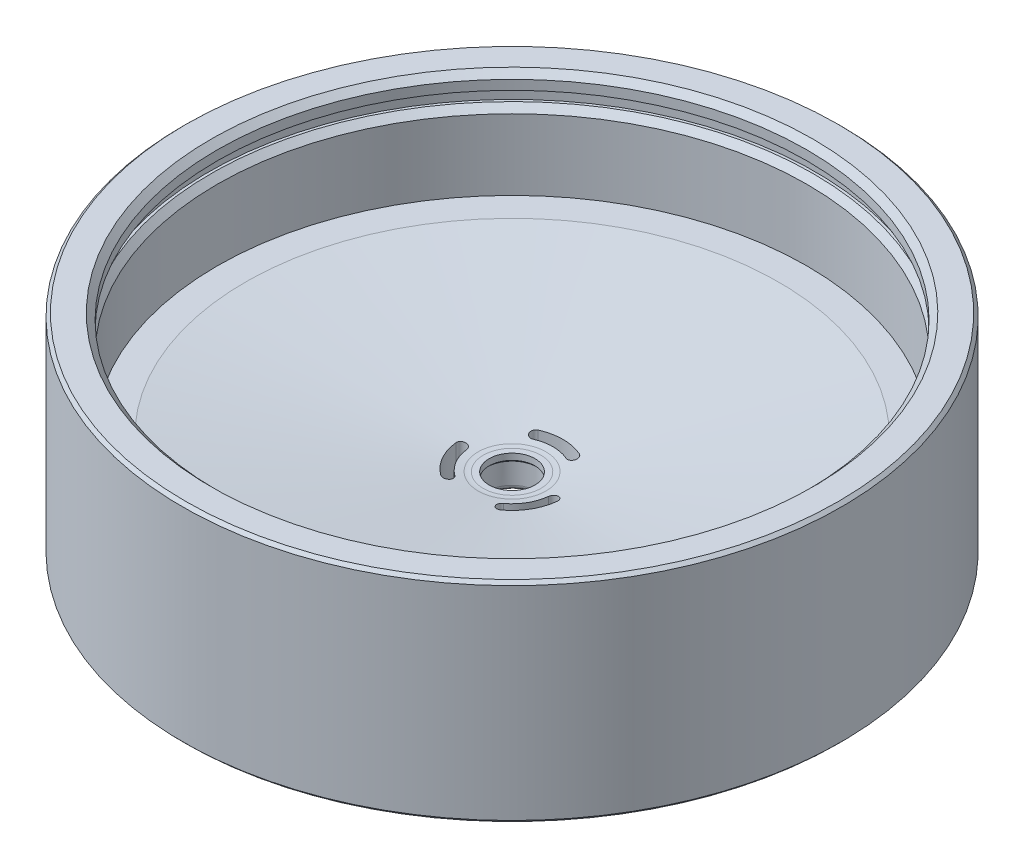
from build123d import *

# Parameters (mm, degrees)
SKETCH2_R          = 2.54
CUT_EXTRUDE1_DEPTH = 2.4972
CUT_EXTRUDE2_DEPTH = 41.203506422
SKETCH7_W          = 7.62
SKETCH7_H          = 5.08
CUT_EXTRUDE3_DEPTH = 1.27
FILLET3_R          = 0.254
FILLET4_R          = 0.39624
FILLET6_R          = 1.6002
CHAMFER1_SIZE      = 0.254
CHAMFER2_SIZE      = 0.5
FILLET9_R          = 3.2


with BuildPart() as part:
    # Sketch1 → Revolve1 (revolve)
    with BuildSketch(Plane.XY, mode=Mode.PRIVATE) as revolve1_sk:
        Polygon((-23.8633, 0), (-26.67, 0), (-26.67, -16.9672), (-25.4, -16.9672), (-25.4, -13.2842), (-17.145, -13.2842), (-17.145, -16.9672), (-15.875, -16.9672), (-15.875, -13.9192), (-1.8542, -13.9192), (-1.8542, -8.636), (-23.8633, -8.636), (-23.8633, -2.413), (-24.5745, -2.413), (-24.5745, -1.27), (-23.8633, -1.27), align=None)
    revolve(revolve1_sk.sketch.rotate(Axis((0, 11.034542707, 0), (0, -1, 0)), 270), axis=Axis((0, 11.034542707, 0), (0, -1, 0)))

    # Sketch2 → Cut-Extrude1 (cut)
    with BuildSketch(Plane(origin=(0, -8.636, 0), x_dir=(1, 0, 0), z_dir=(0, 1, 0))):
        with Locations(Location((0, 0, 0), (0, 0, 270))):
            Circle(SKETCH2_R)
    extrude(amount=-CUT_EXTRUDE1_DEPTH, mode=Mode.SUBTRACT)

    # Sketch3 → Cut-Revolve1 (revolve, cut)
    with BuildSketch(Plane.XY, mode=Mode.PRIVATE) as cut_revolve1_sk:
        Polygon((1.8542, -11.1332), (0, -11.1332), (0, -13.9192), (2.0447, -13.9192), (2.0447, -11.8317), (1.8542, -11.6412), align=None)
    revolve(cut_revolve1_sk.sketch.rotate(Axis((0, 1.750255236, 0), (0, -1, 0)), 90), axis=Axis((0, 1.750255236, 0), (0, -1, 0)), mode=Mode.SUBTRACT)

    # Sketch5 → Cut-Revolve2 (revolve, cut)
    with BuildSketch(Plane.XY, mode=Mode.PRIVATE) as cut_revolve2_sk:
        Polygon((-21.59, -8.636), (-2.54, -11.1332), (-2.54, -8.636), align=None)
    revolve(cut_revolve2_sk.sketch.rotate(Axis((0, 0, 0), (0, -1, 0)), 270), axis=Axis((0, 0, 0), (0, -1, 0)), mode=Mode.SUBTRACT)

    # Sketch4 → Cut-Extrude2 (cut, through all)
    with BuildSketch(Plane.XZ.offset(13.9192)):
        with BuildLine():
            ThreePointArc((-1.334930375, -3.034006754), (-1.870585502, -3.242322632), (-1.662269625, -3.777977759))
            ThreePointArc((-1.662269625, -3.777977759), (0, -4.1275), (1.662269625, -3.777977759))
            ThreePointArc((1.662269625, -3.777977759), (1.870585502, -3.242322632), (1.334930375, -3.034006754))
            ThreePointArc((1.334930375, -3.034006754), (0, -3.3147), (-1.334930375, -3.034006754))
        make_face()
        with BuildLine():
            ThreePointArc((-1.960061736, 2.673086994), (-2.870614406, 1.65735), (-3.294992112, 0.36091976))
            ThreePointArc((-3.294992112, 0.36091976), (-3.743226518, 0.001186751), (-4.102959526, 0.449421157))
            ThreePointArc((-4.102959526, 0.449421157), (-3.574519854, 2.06375), (-2.440689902, 3.328556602))
            ThreePointArc((-2.440689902, 3.328556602), (-1.872641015, 3.241135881), (-1.960061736, 2.673086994))
        make_face()
        with BuildLine():
            ThreePointArc((3.294992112, 0.36091976), (2.870614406, 1.65735), (1.960061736, 2.673086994))
            ThreePointArc((1.960061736, 2.673086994), (1.872641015, 3.241135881), (2.440689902, 3.328556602))
            ThreePointArc((2.440689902, 3.328556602), (3.574519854, 2.06375), (4.102959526, 0.449421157))
            ThreePointArc((4.102959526, 0.449421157), (3.743226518, 0.001186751), (3.294992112, 0.36091976))
        make_face()
    extrude(amount=-CUT_EXTRUDE2_DEPTH, mode=Mode.SUBTRACT)

    # Sketch7 → Cut-Extrude3 (cut)
    with BuildSketch(Plane.XZ.offset(13.2842)):
        with Locations((0, 21.2725)):
            Rectangle(SKETCH7_W, SKETCH7_H)
    extrude(amount=-CUT_EXTRUDE3_DEPTH, mode=Mode.SUBTRACT)

    # Fillet3
    fillet3_edges = [part.edges().sort_by_distance(p)[0] for p in [
        (1.870585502, -13.9192, -3.242322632),
        (0, -13.9192, -3.3147),
        (-1.870585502, -13.9192, -3.242322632),
        (0, -13.9192, -4.1275),
        (-3.743226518, -13.9192, 0.001186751),
        (-2.870614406, -13.9192, 1.65735),
        (-1.872641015, -13.9192, 3.241135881),
        (-3.574519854, -13.9192, 2.06375),
        (1.872641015, -13.9192, 3.241135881),
        (2.870614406, -13.9192, 1.65735),
        (3.743226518, -13.9192, 0.001186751),
        (3.574519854, -13.9192, 2.06375),
    ]]
    fillet(fillet3_edges, radius=FILLET3_R)

    # Fillet4
    fillet4_edges = [part.edges().sort_by_distance(p)[0] for p in [
        (0, -13.9192, -2.0447),
    ]]
    fillet(fillet4_edges, radius=FILLET4_R)

    # Fillet6
    fillet6_edges = [part.edges().sort_by_distance(p)[0] for p in [
        (-3.81, -12.6492, 18.7325),
        (-3.81, -12.6492, 23.8125),
        (3.81, -12.6492, 23.8125),
        (3.81, -12.6492, 18.7325),
    ]]
    fillet(fillet6_edges, radius=FILLET6_R)

    # Chamfer1
    chamfer1_edges = [part.edges().sort_by_distance(p)[0] for p in [
        (0, -16.9672, -26.67),
        (0, 0, -26.67),
    ]]
    chamfer(chamfer1_edges, length=CHAMFER1_SIZE)

    # Chamfer2
    chamfer2_edges = [part.edges().sort_by_distance(p)[0] for p in [
        (0, 0, -23.8633),
        (0, -2.413, -23.8633),
    ]]
    chamfer(chamfer2_edges, length=CHAMFER2_SIZE)

    # Fillet9
    fillet9_edges = [part.edges().sort_by_distance(p)[0] for p in [
        (0, -11.1332, -2.54),
    ]]
    fillet(fillet9_edges, radius=FILLET9_R)


solid = part.part
